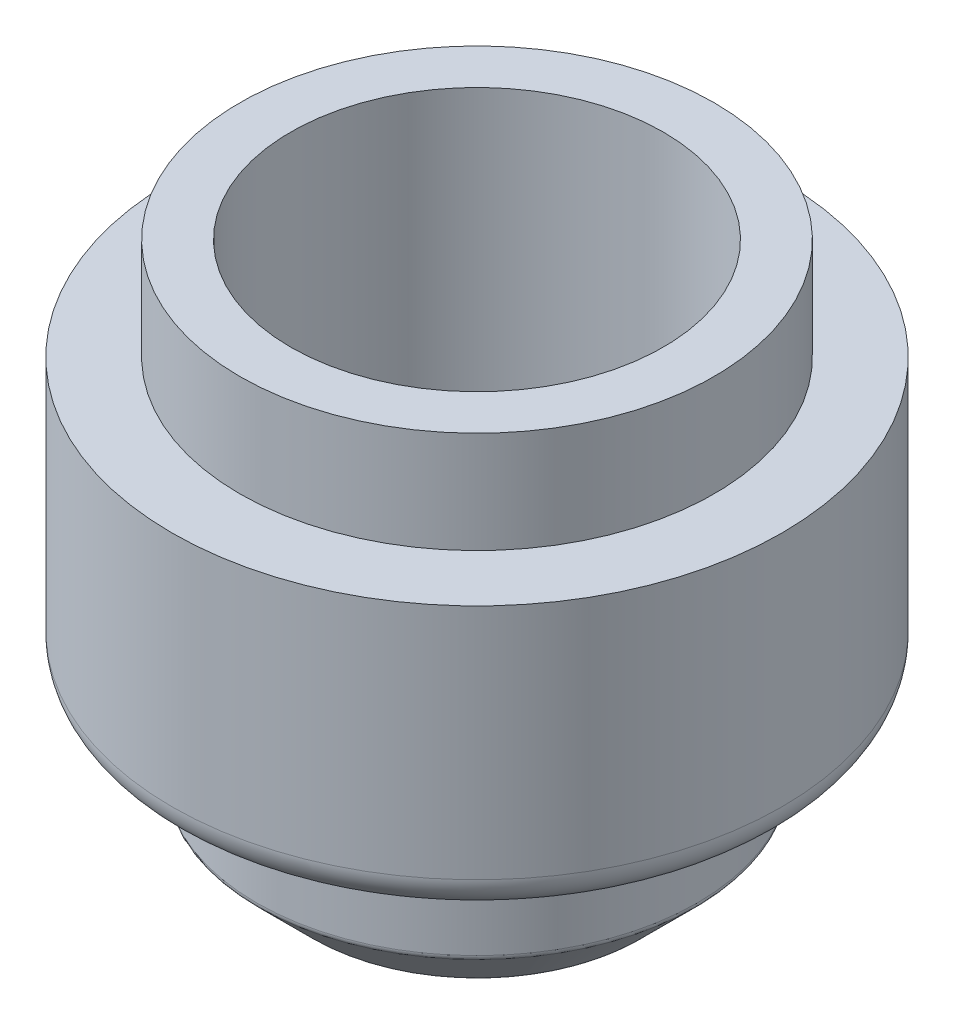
ISO-10303-21;
HEADER;
FILE_DESCRIPTION(('STEP AP214'),'2;1');
FILE_NAME('part.step','',(''),(''),'','','');
FILE_SCHEMA(('AUTOMOTIVE_DESIGN { 1 0 10303 214 1 1 1 1 }'));
ENDSEC;
DATA;
#1=APPLICATION_CONTEXT('core data for automotive mechanical design processes');
#2=APPLICATION_PROTOCOL_DEFINITION('international standard','automotive_design',2000,#1);
#3=PRODUCT_CONTEXT('',#1,'mechanical');
#4=PRODUCT('Part','Part','',(#3));
#5=PRODUCT_RELATED_PRODUCT_CATEGORY('part','',(#4));
#6=PRODUCT_DEFINITION_FORMATION('','',#4);
#7=PRODUCT_DEFINITION_CONTEXT('part definition',#1,'design');
#8=PRODUCT_DEFINITION('design','',#6,#7);
#9=PRODUCT_DEFINITION_SHAPE('','',#8);
#10=(LENGTH_UNIT() NAMED_UNIT(*) SI_UNIT(.MILLI.,.METRE.));
#11=(NAMED_UNIT(*) PLANE_ANGLE_UNIT() SI_UNIT($,.RADIAN.));
#12=(NAMED_UNIT(*) SI_UNIT($,.STERADIAN.) SOLID_ANGLE_UNIT());
#13=UNCERTAINTY_MEASURE_WITH_UNIT(LENGTH_MEASURE(1.E-05),#10,'distance_accuracy_value','');
#14=(GEOMETRIC_REPRESENTATION_CONTEXT(3) GLOBAL_UNCERTAINTY_ASSIGNED_CONTEXT((#13)) GLOBAL_UNIT_ASSIGNED_CONTEXT((#10,
#11,#12)) REPRESENTATION_CONTEXT('',''));
#15=CARTESIAN_POINT('',(0.,0.,0.));
#16=DIRECTION('',(0.,0.,1.));
#17=DIRECTION('',(1.,0.,0.));
#18=AXIS2_PLACEMENT_3D('',#15,#16,#17);
#19=CARTESIAN_POINT('',(-5.11097130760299,32.4510424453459,0.));
#20=DIRECTION('',(0.,1.,0.));
#21=DIRECTION('',(0.,0.,1.));
#22=AXIS2_PLACEMENT_3D('',#19,#20,#21);
#23=PLANE('',#22);
#24=CARTESIAN_POINT('',(3.88902869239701,32.4510424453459,0.));
#25=DIRECTION('',(0.,1.,0.));
#26=DIRECTION('',(0.,0.,1.));
#27=AXIS2_PLACEMENT_3D('',#24,#25,#26);
#28=CIRCLE('',#27,9.);
#29=CARTESIAN_POINT('',(3.88902869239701,32.4510424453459,9.));
#30=VERTEX_POINT('',#29);
#31=EDGE_CURVE('E39',#30,#30,#28,.T.);
#32=ORIENTED_EDGE('',*,*,#31,.T.);
#33=EDGE_LOOP('',(#32));
#34=FACE_BOUND('',#33,.T.);
#35=CARTESIAN_POINT('',(3.88902869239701,32.4510424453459,0.));
#36=DIRECTION('',(0.,1.,0.));
#37=DIRECTION('',(0.,0.,1.));
#38=AXIS2_PLACEMENT_3D('',#35,#36,#37);
#39=CIRCLE('',#38,7.);
#40=CARTESIAN_POINT('',(3.88902869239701,32.4510424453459,7.));
#41=VERTEX_POINT('',#40);
#42=EDGE_CURVE('E108',#41,#41,#39,.T.);
#43=ORIENTED_EDGE('',*,*,#42,.F.);
#44=EDGE_LOOP('',(#43));
#45=FACE_BOUND('',#44,.T.);
#46=ADVANCED_FACE('F29',(#34,#45),#23,.T.);
#47=CARTESIAN_POINT('',(3.88902869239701,35.4510424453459,0.));
#48=DIRECTION('',(0.,1.,0.));
#49=DIRECTION('',(0.,0.,1.));
#50=AXIS2_PLACEMENT_3D('',#47,#48,#49);
#51=CYLINDRICAL_SURFACE('',#50,9.);
#52=CARTESIAN_POINT('',(3.88902869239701,25.4510424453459,0.));
#53=DIRECTION('',(0.,-1.,0.));
#54=DIRECTION('',(0.,0.,-1.));
#55=AXIS2_PLACEMENT_3D('',#52,#53,#54);
#56=CIRCLE('',#55,9.);
#57=CARTESIAN_POINT('',(3.88902869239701,25.4510424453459,-9.));
#58=VERTEX_POINT('',#57);
#59=EDGE_CURVE('E35',#58,#58,#56,.F.);
#60=ORIENTED_EDGE('',*,*,#59,.T.);
#61=EDGE_LOOP('',(#60));
#62=FACE_BOUND('',#61,.T.);
#63=ORIENTED_EDGE('',*,*,#31,.F.);
#64=EDGE_LOOP('',(#63));
#65=FACE_BOUND('',#64,.T.);
#66=ADVANCED_FACE('F116',(#62,#65),#51,.T.);
#67=CARTESIAN_POINT('',(-5.11097130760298,24.4510424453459,0.));
#68=DIRECTION('',(0.,-1.,0.));
#69=DIRECTION('',(0.,0.,-1.));
#70=AXIS2_PLACEMENT_3D('',#67,#68,#69);
#71=PLANE('',#70);
#72=CARTESIAN_POINT('',(3.88902869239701,24.4510424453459,0.));
#73=DIRECTION('',(0.,-1.,0.));
#74=DIRECTION('',(0.,0.,-1.));
#75=AXIS2_PLACEMENT_3D('',#72,#73,#74);
#76=CIRCLE('',#75,8.);
#77=CARTESIAN_POINT('',(3.88902869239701,24.4510424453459,-8.));
#78=VERTEX_POINT('',#77);
#79=EDGE_CURVE('E10',#78,#78,#76,.T.);
#80=ORIENTED_EDGE('',*,*,#79,.T.);
#81=EDGE_LOOP('',(#80));
#82=FACE_BOUND('',#81,.T.);
#83=CARTESIAN_POINT('',(3.88902869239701,24.4510424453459,0.));
#84=DIRECTION('',(0.,1.,0.));
#85=DIRECTION('',(0.,0.,1.));
#86=AXIS2_PLACEMENT_3D('',#83,#84,#85);
#87=CIRCLE('',#86,7.5);
#88=CARTESIAN_POINT('',(3.88902869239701,24.4510424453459,7.5));
#89=VERTEX_POINT('',#88);
#90=EDGE_CURVE('E43',#89,#89,#87,.T.);
#91=ORIENTED_EDGE('',*,*,#90,.T.);
#92=EDGE_LOOP('',(#91));
#93=FACE_BOUND('',#92,.T.);
#94=ADVANCED_FACE('F121',(#82,#93),#71,.T.);
#95=CARTESIAN_POINT('',(3.88902869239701,35.4510424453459,0.));
#96=DIRECTION('',(0.,1.,0.));
#97=DIRECTION('',(0.,0.,1.));
#98=AXIS2_PLACEMENT_3D('',#95,#96,#97);
#99=CYLINDRICAL_SURFACE('',#98,7.5);
#100=CARTESIAN_POINT('',(3.88902869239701,27.2439356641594,0.));
#101=DIRECTION('',(0.,1.,0.));
#102=DIRECTION('',(0.,0.,1.));
#103=AXIS2_PLACEMENT_3D('',#100,#101,#102);
#104=CIRCLE('',#103,7.5);
#105=CARTESIAN_POINT('',(3.88902869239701,27.2439356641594,7.5));
#106=VERTEX_POINT('',#105);
#107=EDGE_CURVE('E48',#106,#106,#104,.T.);
#108=ORIENTED_EDGE('',*,*,#107,.T.);
#109=EDGE_LOOP('',(#108));
#110=FACE_BOUND('',#109,.T.);
#111=ORIENTED_EDGE('',*,*,#90,.F.);
#112=EDGE_LOOP('',(#111));
#113=FACE_BOUND('',#112,.T.);
#114=ADVANCED_FACE('F127',(#110,#113),#99,.F.);
#115=CARTESIAN_POINT('',(3.88902869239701,27.2439356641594,0.));
#116=DIRECTION('',(0.,1.,0.));
#117=DIRECTION('',(0.,0.,1.));
#118=AXIS2_PLACEMENT_3D('',#115,#116,#117);
#119=TOROIDAL_SURFACE('',#118,8.,0.5);
#120=CARTESIAN_POINT('',(3.88902869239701,27.5974890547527,0.));
#121=DIRECTION('',(0.,1.,0.));
#122=DIRECTION('',(0.,0.,1.));
#123=AXIS2_PLACEMENT_3D('',#120,#121,#122);
#124=CIRCLE('',#123,7.64644660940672);
#125=CARTESIAN_POINT('',(3.88902869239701,27.5974890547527,7.64644660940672));
#126=VERTEX_POINT('',#125);
#127=EDGE_CURVE('E51',#126,#126,#124,.T.);
#128=ORIENTED_EDGE('',*,*,#127,.T.);
#129=EDGE_LOOP('',(#128));
#130=FACE_BOUND('',#129,.T.);
#131=ORIENTED_EDGE('',*,*,#107,.F.);
#132=EDGE_LOOP('',(#131));
#133=FACE_BOUND('',#132,.T.);
#134=ADVANCED_FACE('F132',(#130,#133),#119,.T.);
#135=CARTESIAN_POINT('',(3.88902869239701,27.5974890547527,0.));
#136=DIRECTION('',(0.,1.,0.));
#137=DIRECTION('',(0.,0.,1.));
#138=AXIS2_PLACEMENT_3D('',#135,#136,#137);
#139=CONICAL_SURFACE('',#138,7.64644660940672,0.785398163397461);
#140=CARTESIAN_POINT('',(3.88902869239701,27.7035555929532,0.));
#141=DIRECTION('',(0.,1.,0.));
#142=DIRECTION('',(0.,0.,1.));
#143=AXIS2_PLACEMENT_3D('',#140,#141,#142);
#144=CIRCLE('',#143,7.75251314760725);
#145=CARTESIAN_POINT('',(3.88902869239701,27.7035555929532,7.75251314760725));
#146=VERTEX_POINT('',#145);
#147=EDGE_CURVE('E54',#146,#146,#144,.T.);
#148=ORIENTED_EDGE('',*,*,#147,.T.);
#149=EDGE_LOOP('',(#148));
#150=FACE_BOUND('',#149,.T.);
#151=ORIENTED_EDGE('',*,*,#127,.F.);
#152=EDGE_LOOP('',(#151));
#153=FACE_BOUND('',#152,.T.);
#154=ADVANCED_FACE('F136',(#150,#153),#139,.F.);
#155=CARTESIAN_POINT('',(3.88902869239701,28.0571089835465,0.));
#156=DIRECTION('',(0.,1.,0.));
#157=DIRECTION('',(0.,0.,1.));
#158=AXIS2_PLACEMENT_3D('',#155,#156,#157);
#159=TOROIDAL_SURFACE('',#158,7.39895975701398,0.5);
#160=CARTESIAN_POINT('',(3.88902869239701,28.4106623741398,0.));
#161=DIRECTION('',(0.,1.,0.));
#162=DIRECTION('',(0.,0.,1.));
#163=AXIS2_PLACEMENT_3D('',#160,#161,#162);
#164=CIRCLE('',#163,7.04540636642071);
#165=CARTESIAN_POINT('',(3.88902869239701,28.4106623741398,7.04540636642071));
#166=VERTEX_POINT('',#165);
#167=EDGE_CURVE('E57',#166,#166,#164,.T.);
#168=ORIENTED_EDGE('',*,*,#167,.T.);
#169=EDGE_LOOP('',(#168));
#170=FACE_BOUND('',#169,.T.);
#171=ORIENTED_EDGE('',*,*,#147,.F.);
#172=EDGE_LOOP('',(#171));
#173=FACE_BOUND('',#172,.T.);
#174=ADVANCED_FACE('F140',(#170,#173),#159,.F.);
#175=CARTESIAN_POINT('',(3.88902869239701,28.4106623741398,0.));
#176=DIRECTION('',(0.,1.,0.));
#177=DIRECTION('',(0.,0.,1.));
#178=AXIS2_PLACEMENT_3D('',#175,#176,#177);
#179=CONICAL_SURFACE('',#178,7.04540636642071,0.785398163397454);
#180=CARTESIAN_POINT('',(3.88902869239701,28.0117026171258,0.));
#181=DIRECTION('',(0.,1.,0.));
#182=DIRECTION('',(0.,0.,1.));
#183=AXIS2_PLACEMENT_3D('',#180,#181,#182);
#184=CIRCLE('',#183,6.64644660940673);
#185=CARTESIAN_POINT('',(3.88902869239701,28.0117026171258,6.64644660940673));
#186=VERTEX_POINT('',#185);
#187=EDGE_CURVE('E60',#186,#186,#184,.T.);
#188=ORIENTED_EDGE('',*,*,#187,.T.);
#189=EDGE_LOOP('',(#188));
#190=FACE_BOUND('',#189,.T.);
#191=ORIENTED_EDGE('',*,*,#167,.F.);
#192=EDGE_LOOP('',(#191));
#193=FACE_BOUND('',#192,.T.);
#194=ADVANCED_FACE('F144',(#190,#193),#179,.T.);
#195=CARTESIAN_POINT('',(3.88902869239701,27.6581492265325,0.));
#196=DIRECTION('',(0.,1.,0.));
#197=DIRECTION('',(0.,0.,1.));
#198=AXIS2_PLACEMENT_3D('',#195,#196,#197);
#199=TOROIDAL_SURFACE('',#198,7.,0.5);
#200=CARTESIAN_POINT('',(3.88902869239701,27.6581492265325,0.));
#201=DIRECTION('',(0.,1.,0.));
#202=DIRECTION('',(0.,0.,1.));
#203=AXIS2_PLACEMENT_3D('',#200,#201,#202);
#204=CIRCLE('',#203,6.5);
#205=CARTESIAN_POINT('',(3.88902869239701,27.6581492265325,6.5));
#206=VERTEX_POINT('',#205);
#207=EDGE_CURVE('E63',#206,#206,#204,.T.);
#208=ORIENTED_EDGE('',*,*,#207,.T.);
#209=EDGE_LOOP('',(#208));
#210=FACE_BOUND('',#209,.T.);
#211=ORIENTED_EDGE('',*,*,#187,.F.);
#212=EDGE_LOOP('',(#211));
#213=FACE_BOUND('',#212,.T.);
#214=ADVANCED_FACE('F148',(#210,#213),#199,.F.);
#215=CARTESIAN_POINT('',(3.88902869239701,35.4510424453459,0.));
#216=DIRECTION('',(0.,1.,0.));
#217=DIRECTION('',(0.,0.,1.));
#218=AXIS2_PLACEMENT_3D('',#215,#216,#217);
#219=CYLINDRICAL_SURFACE('',#218,6.5);
#220=CARTESIAN_POINT('',(3.88902869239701,21.7439356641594,0.));
#221=DIRECTION('',(0.,1.,0.));
#222=DIRECTION('',(0.,0.,1.));
#223=AXIS2_PLACEMENT_3D('',#220,#221,#222);
#224=CIRCLE('',#223,6.5);
#225=CARTESIAN_POINT('',(3.88902869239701,21.7439356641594,6.5));
#226=VERTEX_POINT('',#225);
#227=EDGE_CURVE('E66',#226,#226,#224,.T.);
#228=ORIENTED_EDGE('',*,*,#227,.T.);
#229=EDGE_LOOP('',(#228));
#230=FACE_BOUND('',#229,.T.);
#231=ORIENTED_EDGE('',*,*,#207,.F.);
#232=EDGE_LOOP('',(#231));
#233=FACE_BOUND('',#232,.T.);
#234=ADVANCED_FACE('F152',(#230,#233),#219,.T.);
#235=CARTESIAN_POINT('',(3.88902869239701,21.7439356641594,0.));
#236=DIRECTION('',(0.,1.,0.));
#237=DIRECTION('',(0.,0.,1.));
#238=AXIS2_PLACEMENT_3D('',#235,#236,#237);
#239=TOROIDAL_SURFACE('',#238,6.3,0.200000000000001);
#240=CARTESIAN_POINT('',(3.88902869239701,21.6025143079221,0.));
#241=DIRECTION('',(0.,1.,0.));
#242=DIRECTION('',(0.,0.,1.));
#243=AXIS2_PLACEMENT_3D('',#240,#241,#242);
#244=CIRCLE('',#243,6.44142135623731);
#245=CARTESIAN_POINT('',(3.88902869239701,21.6025143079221,6.44142135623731));
#246=VERTEX_POINT('',#245);
#247=EDGE_CURVE('E69',#246,#246,#244,.T.);
#248=ORIENTED_EDGE('',*,*,#247,.T.);
#249=EDGE_LOOP('',(#248));
#250=FACE_BOUND('',#249,.T.);
#251=ORIENTED_EDGE('',*,*,#227,.F.);
#252=EDGE_LOOP('',(#251));
#253=FACE_BOUND('',#252,.T.);
#254=ADVANCED_FACE('F156',(#250,#253),#239,.T.);
#255=CARTESIAN_POINT('',(3.88902869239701,21.6025143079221,0.));
#256=DIRECTION('',(0.,1.,0.));
#257=DIRECTION('',(0.,0.,1.));
#258=AXIS2_PLACEMENT_3D('',#255,#256,#257);
#259=CONICAL_SURFACE('',#258,6.44142135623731,0.785398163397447);
#260=CARTESIAN_POINT('',(3.88902869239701,20.0025143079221,0.));
#261=DIRECTION('',(0.,1.,0.));
#262=DIRECTION('',(0.,0.,1.));
#263=AXIS2_PLACEMENT_3D('',#260,#261,#262);
#264=CIRCLE('',#263,4.84142135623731);
#265=CARTESIAN_POINT('',(3.88902869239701,20.0025143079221,4.84142135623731));
#266=VERTEX_POINT('',#265);
#267=EDGE_CURVE('E72',#266,#266,#264,.T.);
#268=ORIENTED_EDGE('',*,*,#267,.T.);
#269=EDGE_LOOP('',(#268));
#270=FACE_BOUND('',#269,.T.);
#271=ORIENTED_EDGE('',*,*,#247,.F.);
#272=EDGE_LOOP('',(#271));
#273=FACE_BOUND('',#272,.T.);
#274=ADVANCED_FACE('F160',(#270,#273),#259,.T.);
#275=CARTESIAN_POINT('',(3.88902869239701,20.1439356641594,0.));
#276=DIRECTION('',(0.,1.,0.));
#277=DIRECTION('',(0.,0.,1.));
#278=AXIS2_PLACEMENT_3D('',#275,#276,#277);
#279=TOROIDAL_SURFACE('',#278,4.7,0.200000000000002);
#280=CARTESIAN_POINT('',(3.88902869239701,20.1439356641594,0.));
#281=DIRECTION('',(0.,1.,0.));
#282=DIRECTION('',(0.,0.,1.));
#283=AXIS2_PLACEMENT_3D('',#280,#281,#282);
#284=CIRCLE('',#283,4.5);
#285=CARTESIAN_POINT('',(3.88902869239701,20.1439356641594,4.5));
#286=VERTEX_POINT('',#285);
#287=EDGE_CURVE('E75',#286,#286,#284,.T.);
#288=ORIENTED_EDGE('',*,*,#287,.T.);
#289=EDGE_LOOP('',(#288));
#290=FACE_BOUND('',#289,.T.);
#291=ORIENTED_EDGE('',*,*,#267,.F.);
#292=EDGE_LOOP('',(#291));
#293=FACE_BOUND('',#292,.T.);
#294=ADVANCED_FACE('F164',(#290,#293),#279,.T.);
#295=CARTESIAN_POINT('',(3.88902869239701,35.4510424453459,0.));
#296=DIRECTION('',(0.,1.,0.));
#297=DIRECTION('',(0.,0.,1.));
#298=AXIS2_PLACEMENT_3D('',#295,#296,#297);
#299=CYLINDRICAL_SURFACE('',#298,4.5);
#300=CARTESIAN_POINT('',(3.88902869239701,20.2853570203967,0.));
#301=DIRECTION('',(0.,1.,0.));
#302=DIRECTION('',(0.,0.,1.));
#303=AXIS2_PLACEMENT_3D('',#300,#301,#302);
#304=CIRCLE('',#303,4.5);
#305=CARTESIAN_POINT('',(3.88902869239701,20.2853570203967,4.5));
#306=VERTEX_POINT('',#305);
#307=EDGE_CURVE('E78',#306,#306,#304,.T.);
#308=ORIENTED_EDGE('',*,*,#307,.T.);
#309=EDGE_LOOP('',(#308));
#310=FACE_BOUND('',#309,.T.);
#311=ORIENTED_EDGE('',*,*,#287,.F.);
#312=EDGE_LOOP('',(#311));
#313=FACE_BOUND('',#312,.T.);
#314=ADVANCED_FACE('F168',(#310,#313),#299,.F.);
#315=CARTESIAN_POINT('',(3.88902869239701,20.2853570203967,0.));
#316=DIRECTION('',(0.,1.,0.));
#317=DIRECTION('',(0.,0.,1.));
#318=AXIS2_PLACEMENT_3D('',#315,#316,#317);
#319=TOROIDAL_SURFACE('',#318,4.7,0.199999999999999);
#320=CARTESIAN_POINT('',(3.88902869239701,20.426778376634,0.));
#321=DIRECTION('',(0.,1.,0.));
#322=DIRECTION('',(0.,0.,1.));
#323=AXIS2_PLACEMENT_3D('',#320,#321,#322);
#324=CIRCLE('',#323,4.55857864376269);
#325=CARTESIAN_POINT('',(3.88902869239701,20.426778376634,4.55857864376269));
#326=VERTEX_POINT('',#325);
#327=EDGE_CURVE('E81',#326,#326,#324,.T.);
#328=ORIENTED_EDGE('',*,*,#327,.T.);
#329=EDGE_LOOP('',(#328));
#330=FACE_BOUND('',#329,.T.);
#331=ORIENTED_EDGE('',*,*,#307,.F.);
#332=EDGE_LOOP('',(#331));
#333=FACE_BOUND('',#332,.T.);
#334=ADVANCED_FACE('F172',(#330,#333),#319,.T.);
#335=CARTESIAN_POINT('',(3.88902869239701,20.426778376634,0.));
#336=DIRECTION('',(0.,1.,0.));
#337=DIRECTION('',(0.,0.,1.));
#338=AXIS2_PLACEMENT_3D('',#335,#336,#337);
#339=CONICAL_SURFACE('',#338,4.55857864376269,0.785398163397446);
#340=CARTESIAN_POINT('',(3.88902869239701,21.8096210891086,0.));
#341=DIRECTION('',(0.,1.,0.));
#342=DIRECTION('',(0.,0.,1.));
#343=AXIS2_PLACEMENT_3D('',#340,#341,#342);
#344=CIRCLE('',#343,5.94142135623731);
#345=CARTESIAN_POINT('',(3.88902869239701,21.8096210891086,5.94142135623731));
#346=VERTEX_POINT('',#345);
#347=EDGE_CURVE('E84',#346,#346,#344,.T.);
#348=ORIENTED_EDGE('',*,*,#347,.T.);
#349=EDGE_LOOP('',(#348));
#350=FACE_BOUND('',#349,.T.);
#351=ORIENTED_EDGE('',*,*,#327,.F.);
#352=EDGE_LOOP('',(#351));
#353=FACE_BOUND('',#352,.T.);
#354=ADVANCED_FACE('F176',(#350,#353),#339,.F.);
#355=CARTESIAN_POINT('',(3.88902869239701,21.9510424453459,0.));
#356=DIRECTION('',(0.,1.,0.));
#357=DIRECTION('',(0.,0.,1.));
#358=AXIS2_PLACEMENT_3D('',#355,#356,#357);
#359=TOROIDAL_SURFACE('',#358,5.8,0.199999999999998);
#360=CARTESIAN_POINT('',(3.88902869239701,21.9510424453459,0.));
#361=DIRECTION('',(0.,1.,0.));
#362=DIRECTION('',(0.,0.,1.));
#363=AXIS2_PLACEMENT_3D('',#360,#361,#362);
#364=CIRCLE('',#363,6.);
#365=CARTESIAN_POINT('',(3.88902869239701,21.9510424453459,6.));
#366=VERTEX_POINT('',#365);
#367=EDGE_CURVE('E87',#366,#366,#364,.T.);
#368=ORIENTED_EDGE('',*,*,#367,.T.);
#369=EDGE_LOOP('',(#368));
#370=FACE_BOUND('',#369,.T.);
#371=ORIENTED_EDGE('',*,*,#347,.F.);
#372=EDGE_LOOP('',(#371));
#373=FACE_BOUND('',#372,.T.);
#374=ADVANCED_FACE('F180',(#370,#373),#359,.F.);
#375=CARTESIAN_POINT('',(3.88902869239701,35.4510424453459,0.));
#376=DIRECTION('',(0.,1.,0.));
#377=DIRECTION('',(0.,0.,1.));
#378=AXIS2_PLACEMENT_3D('',#375,#376,#377);
#379=CYLINDRICAL_SURFACE('',#378,6.);
#380=CARTESIAN_POINT('',(3.88902869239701,25.9510424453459,0.));
#381=DIRECTION('',(0.,1.,0.));
#382=DIRECTION('',(0.,0.,1.));
#383=AXIS2_PLACEMENT_3D('',#380,#381,#382);
#384=CIRCLE('',#383,6.);
#385=CARTESIAN_POINT('',(3.88902869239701,25.9510424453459,6.));
#386=VERTEX_POINT('',#385);
#387=EDGE_CURVE('E90',#386,#386,#384,.T.);
#388=ORIENTED_EDGE('',*,*,#387,.T.);
#389=EDGE_LOOP('',(#388));
#390=FACE_BOUND('',#389,.T.);
#391=ORIENTED_EDGE('',*,*,#367,.F.);
#392=EDGE_LOOP('',(#391));
#393=FACE_BOUND('',#392,.T.);
#394=ADVANCED_FACE('F184',(#390,#393),#379,.F.);
#395=CARTESIAN_POINT('',(0.389028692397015,25.9510424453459,0.));
#396=DIRECTION('',(0.,-1.,0.));
#397=DIRECTION('',(0.,0.,-1.));
#398=AXIS2_PLACEMENT_3D('',#395,#396,#397);
#399=PLANE('',#398);
#400=CARTESIAN_POINT('',(3.88902869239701,25.9510424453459,0.));
#401=DIRECTION('',(0.,1.,0.));
#402=DIRECTION('',(0.,0.,1.));
#403=AXIS2_PLACEMENT_3D('',#400,#401,#402);
#404=CIRCLE('',#403,3.5);
#405=CARTESIAN_POINT('',(3.88902869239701,25.9510424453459,3.5));
#406=VERTEX_POINT('',#405);
#407=EDGE_CURVE('E93',#406,#406,#404,.T.);
#408=ORIENTED_EDGE('',*,*,#407,.T.);
#409=EDGE_LOOP('',(#408));
#410=FACE_BOUND('',#409,.T.);
#411=ORIENTED_EDGE('',*,*,#387,.F.);
#412=EDGE_LOOP('',(#411));
#413=FACE_BOUND('',#412,.T.);
#414=ADVANCED_FACE('F188',(#410,#413),#399,.T.);
#415=CARTESIAN_POINT('',(3.88902869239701,35.4510424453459,0.));
#416=DIRECTION('',(0.,1.,0.));
#417=DIRECTION('',(0.,0.,1.));
#418=AXIS2_PLACEMENT_3D('',#415,#416,#417);
#419=CYLINDRICAL_SURFACE('',#418,3.5);
#420=CARTESIAN_POINT('',(3.88902869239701,27.4510424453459,0.));
#421=DIRECTION('',(0.,1.,0.));
#422=DIRECTION('',(0.,0.,1.));
#423=AXIS2_PLACEMENT_3D('',#420,#421,#422);
#424=CIRCLE('',#423,3.5);
#425=CARTESIAN_POINT('',(3.88902869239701,27.4510424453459,3.5));
#426=VERTEX_POINT('',#425);
#427=EDGE_CURVE('E96',#426,#426,#424,.T.);
#428=ORIENTED_EDGE('',*,*,#427,.T.);
#429=EDGE_LOOP('',(#428));
#430=FACE_BOUND('',#429,.T.);
#431=ORIENTED_EDGE('',*,*,#407,.F.);
#432=EDGE_LOOP('',(#431));
#433=FACE_BOUND('',#432,.T.);
#434=ADVANCED_FACE('F192',(#430,#433),#419,.F.);
#435=CARTESIAN_POINT('',(-1.61097130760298,27.4510424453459,0.));
#436=DIRECTION('',(0.,1.,0.));
#437=DIRECTION('',(0.,0.,1.));
#438=AXIS2_PLACEMENT_3D('',#435,#436,#437);
#439=PLANE('',#438);
#440=CARTESIAN_POINT('',(3.88902869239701,27.4510424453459,0.));
#441=DIRECTION('',(0.,1.,0.));
#442=DIRECTION('',(0.,0.,1.));
#443=AXIS2_PLACEMENT_3D('',#440,#441,#442);
#444=CIRCLE('',#443,5.5);
#445=CARTESIAN_POINT('',(3.88902869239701,27.4510424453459,5.5));
#446=VERTEX_POINT('',#445);
#447=EDGE_CURVE('E99',#446,#446,#444,.T.);
#448=ORIENTED_EDGE('',*,*,#447,.T.);
#449=EDGE_LOOP('',(#448));
#450=FACE_BOUND('',#449,.T.);
#451=ORIENTED_EDGE('',*,*,#427,.F.);
#452=EDGE_LOOP('',(#451));
#453=FACE_BOUND('',#452,.T.);
#454=ADVANCED_FACE('F196',(#450,#453),#439,.T.);
#455=CARTESIAN_POINT('',(3.88902869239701,35.4510424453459,0.));
#456=DIRECTION('',(0.,1.,0.));
#457=DIRECTION('',(0.,0.,1.));
#458=AXIS2_PLACEMENT_3D('',#455,#456,#457);
#459=CYLINDRICAL_SURFACE('',#458,5.5);
#460=CARTESIAN_POINT('',(3.88902869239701,35.4510424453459,0.));
#461=DIRECTION('',(0.,1.,0.));
#462=DIRECTION('',(0.,0.,1.));
#463=AXIS2_PLACEMENT_3D('',#460,#461,#462);
#464=CIRCLE('',#463,5.5);
#465=CARTESIAN_POINT('',(3.88902869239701,35.4510424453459,5.5));
#466=VERTEX_POINT('',#465);
#467=EDGE_CURVE('E102',#466,#466,#464,.T.);
#468=ORIENTED_EDGE('',*,*,#467,.T.);
#469=EDGE_LOOP('',(#468));
#470=FACE_BOUND('',#469,.T.);
#471=ORIENTED_EDGE('',*,*,#447,.F.);
#472=EDGE_LOOP('',(#471));
#473=FACE_BOUND('',#472,.T.);
#474=ADVANCED_FACE('F200',(#470,#473),#459,.F.);
#475=CARTESIAN_POINT('',(-3.11097130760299,35.4510424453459,0.));
#476=DIRECTION('',(0.,1.,0.));
#477=DIRECTION('',(0.,0.,1.));
#478=AXIS2_PLACEMENT_3D('',#475,#476,#477);
#479=PLANE('',#478);
#480=CARTESIAN_POINT('',(3.88902869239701,35.4510424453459,0.));
#481=DIRECTION('',(0.,1.,0.));
#482=DIRECTION('',(0.,0.,1.));
#483=AXIS2_PLACEMENT_3D('',#480,#481,#482);
#484=CIRCLE('',#483,7.);
#485=CARTESIAN_POINT('',(3.88902869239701,35.4510424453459,7.));
#486=VERTEX_POINT('',#485);
#487=EDGE_CURVE('E105',#486,#486,#484,.T.);
#488=ORIENTED_EDGE('',*,*,#487,.T.);
#489=EDGE_LOOP('',(#488));
#490=FACE_BOUND('',#489,.T.);
#491=ORIENTED_EDGE('',*,*,#467,.F.);
#492=EDGE_LOOP('',(#491));
#493=FACE_BOUND('',#492,.T.);
#494=ADVANCED_FACE('F204',(#490,#493),#479,.T.);
#495=CARTESIAN_POINT('',(3.88902869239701,35.4510424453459,0.));
#496=DIRECTION('',(0.,1.,0.));
#497=DIRECTION('',(0.,0.,1.));
#498=AXIS2_PLACEMENT_3D('',#495,#496,#497);
#499=CYLINDRICAL_SURFACE('',#498,7.);
#500=ORIENTED_EDGE('',*,*,#42,.T.);
#501=EDGE_LOOP('',(#500));
#502=FACE_BOUND('',#501,.T.);
#503=ORIENTED_EDGE('',*,*,#487,.F.);
#504=EDGE_LOOP('',(#503));
#505=FACE_BOUND('',#504,.T.);
#506=ADVANCED_FACE('F112',(#502,#505),#499,.T.);
#507=CARTESIAN_POINT('',(3.88902869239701,25.4510424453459,0.));
#508=DIRECTION('',(0.,-1.,0.));
#509=DIRECTION('',(0.,0.,-1.));
#510=AXIS2_PLACEMENT_3D('',#507,#508,#509);
#511=TOROIDAL_SURFACE('',#510,8.,1.);
#512=ORIENTED_EDGE('',*,*,#79,.F.);
#513=EDGE_LOOP('',(#512));
#514=FACE_BOUND('',#513,.T.);
#515=ORIENTED_EDGE('',*,*,#59,.F.);
#516=EDGE_LOOP('',(#515));
#517=FACE_BOUND('',#516,.T.);
#518=ADVANCED_FACE('F211',(#514,#517),#511,.T.);
#519=CLOSED_SHELL('',(#46,#66,#94,#114,#134,#154,#174,#194,#214,#234,#254,#274,#294,#314,#334,
#354,#374,#394,#414,#434,#454,#474,#494,#506,#518));
#520=MANIFOLD_SOLID_BREP('B2',#519);
#521=ADVANCED_BREP_SHAPE_REPRESENTATION('',(#18,#520),#14);
#522=SHAPE_DEFINITION_REPRESENTATION(#9,#521);
ENDSEC;
END-ISO-10303-21;
